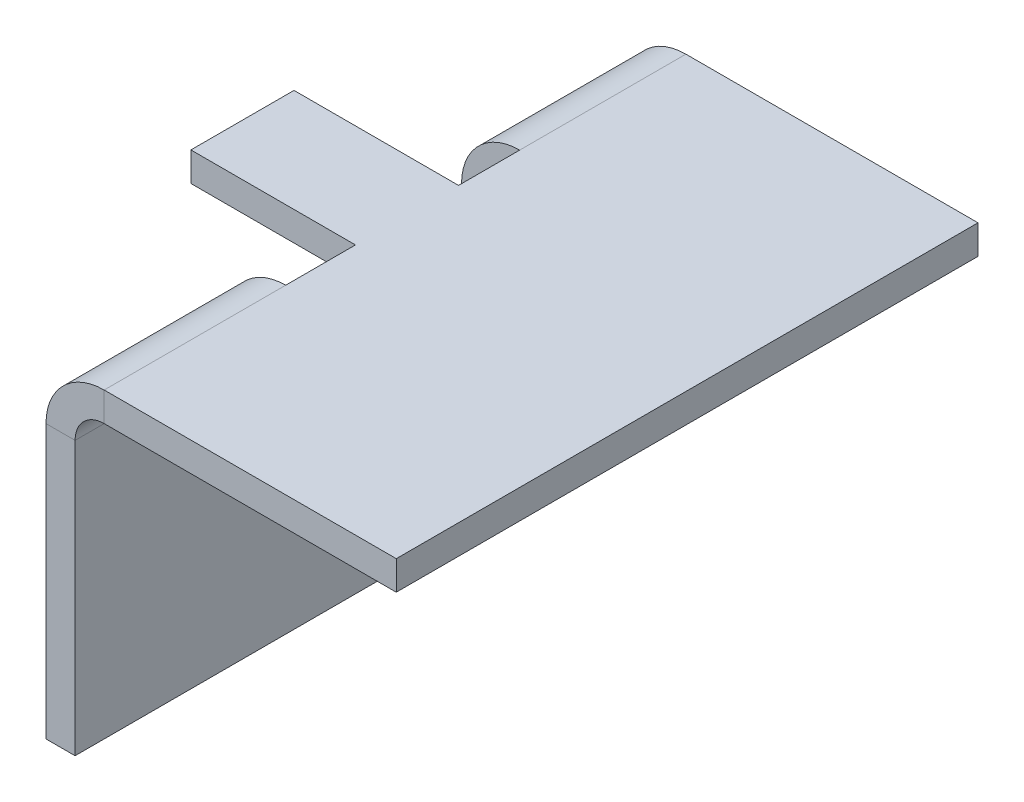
ISO-10303-21;
HEADER;
FILE_DESCRIPTION(('STEP AP214'),'2;1');
FILE_NAME('part.step','',(''),(''),'','','');
FILE_SCHEMA(('AUTOMOTIVE_DESIGN { 1 0 10303 214 1 1 1 1 }'));
ENDSEC;
DATA;
#1=APPLICATION_CONTEXT('core data for automotive mechanical design processes');
#2=APPLICATION_PROTOCOL_DEFINITION('international standard','automotive_design',2000,#1);
#3=PRODUCT_CONTEXT('',#1,'mechanical');
#4=PRODUCT('Part','Part','',(#3));
#5=PRODUCT_RELATED_PRODUCT_CATEGORY('part','',(#4));
#6=PRODUCT_DEFINITION_FORMATION('','',#4);
#7=PRODUCT_DEFINITION_CONTEXT('part definition',#1,'design');
#8=PRODUCT_DEFINITION('design','',#6,#7);
#9=PRODUCT_DEFINITION_SHAPE('','',#8);
#10=(LENGTH_UNIT() NAMED_UNIT(*) SI_UNIT(.MILLI.,.METRE.));
#11=(NAMED_UNIT(*) PLANE_ANGLE_UNIT() SI_UNIT($,.RADIAN.));
#12=(NAMED_UNIT(*) SI_UNIT($,.STERADIAN.) SOLID_ANGLE_UNIT());
#13=UNCERTAINTY_MEASURE_WITH_UNIT(LENGTH_MEASURE(1.E-05),#10,'distance_accuracy_value','');
#14=(GEOMETRIC_REPRESENTATION_CONTEXT(3) GLOBAL_UNCERTAINTY_ASSIGNED_CONTEXT((#13)) GLOBAL_UNIT_ASSIGNED_CONTEXT((#10,
#11,#12)) REPRESENTATION_CONTEXT('',''));
#15=CARTESIAN_POINT('',(0.,0.,0.));
#16=DIRECTION('',(0.,0.,1.));
#17=DIRECTION('',(1.,0.,0.));
#18=AXIS2_PLACEMENT_3D('',#15,#16,#17);
#19=CARTESIAN_POINT('',(6.,-3.,-0.790229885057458));
#20=DIRECTION('',(1.,0.,0.));
#21=DIRECTION('',(0.,0.,-1.));
#22=AXIS2_PLACEMENT_3D('',#19,#20,#21);
#23=PLANE('',#22);
#24=DIRECTION('',(0.,1.,0.));
#25=VECTOR('',#24,1.);
#26=CARTESIAN_POINT('',(6.,-3.,4.08177323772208));
#27=LINE('',#26,#25);
#28=CARTESIAN_POINT('',(6.,-3.,4.08177323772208));
#29=VERTEX_POINT('',#28);
#30=CARTESIAN_POINT('',(6.,0.,4.08177323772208));
#31=VERTEX_POINT('',#30);
#32=EDGE_CURVE('E512',#29,#31,#27,.T.);
#33=ORIENTED_EDGE('',*,*,#32,.F.);
#34=DIRECTION('',(0.,0.,-1.));
#35=VECTOR('',#34,1.);
#36=CARTESIAN_POINT('',(6.,-3.,30.));
#37=LINE('',#36,#35);
#38=CARTESIAN_POINT('',(6.,-3.,11.2787356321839));
#39=VERTEX_POINT('',#38);
#40=EDGE_CURVE('E523',#39,#29,#37,.T.);
#41=ORIENTED_EDGE('',*,*,#40,.F.);
#42=DIRECTION('',(0.,-1.,0.));
#43=VECTOR('',#42,1.);
#44=CARTESIAN_POINT('',(6.,-3.,11.2787356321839));
#45=LINE('',#44,#43);
#46=CARTESIAN_POINT('',(6.,0.,11.2787356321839));
#47=VERTEX_POINT('',#46);
#48=EDGE_CURVE('E528',#39,#47,#45,.F.);
#49=ORIENTED_EDGE('',*,*,#48,.T.);
#50=DIRECTION('',(0.,0.,-1.));
#51=VECTOR('',#50,1.);
#52=CARTESIAN_POINT('',(6.,0.,30.));
#53=LINE('',#52,#51);
#54=EDGE_CURVE('E367',#47,#31,#53,.T.);
#55=ORIENTED_EDGE('',*,*,#54,.T.);
#56=EDGE_LOOP('',(#33,#41,#49,#55));
#57=FACE_BOUND('',#56,.T.);
#58=ADVANCED_FACE('F352',(#57),#23,.F.);
#59=CARTESIAN_POINT('',(6.,-6.,30.));
#60=DIRECTION('',(0.,0.,-1.));
#61=DIRECTION('',(-1.,0.,0.));
#62=AXIS2_PLACEMENT_3D('',#59,#60,#61);
#63=CYLINDRICAL_SURFACE('',#62,6.);
#64=DIRECTION('',(0.,0.,-1.));
#65=VECTOR('',#64,1.);
#66=CARTESIAN_POINT('',(0.,-6.,30.));
#67=LINE('',#66,#65);
#68=CARTESIAN_POINT('',(0.,-6.00000000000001,-12.8591954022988));
#69=VERTEX_POINT('',#68);
#70=CARTESIAN_POINT('',(0.,-6.,-30.));
#71=VERTEX_POINT('',#70);
#72=EDGE_CURVE('E619',#69,#71,#67,.T.);
#73=ORIENTED_EDGE('',*,*,#72,.F.);
#74=CARTESIAN_POINT('',(6.,-6.,-12.8591954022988));
#75=DIRECTION('',(0.,0.,-1.));
#76=DIRECTION('',(-1.,0.,0.));
#77=AXIS2_PLACEMENT_3D('',#74,#75,#76);
#78=CIRCLE('',#77,6.);
#79=CARTESIAN_POINT('',(6.,0.,-12.8591954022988));
#80=VERTEX_POINT('',#79);
#81=EDGE_CURVE('E486',#80,#69,#78,.F.);
#82=ORIENTED_EDGE('',*,*,#81,.F.);
#83=DIRECTION('',(0.,0.,-1.));
#84=VECTOR('',#83,1.);
#85=CARTESIAN_POINT('',(6.,0.,30.));
#86=LINE('',#85,#84);
#87=CARTESIAN_POINT('',(6.,0.,-30.));
#88=VERTEX_POINT('',#87);
#89=EDGE_CURVE('E484',#80,#88,#86,.T.);
#90=ORIENTED_EDGE('',*,*,#89,.T.);
#91=CARTESIAN_POINT('',(6.,-6.,-30.));
#92=DIRECTION('',(0.,0.,1.));
#93=DIRECTION('',(1.,0.,0.));
#94=AXIS2_PLACEMENT_3D('',#91,#92,#93);
#95=CIRCLE('',#94,6.);
#96=EDGE_CURVE('E569',#71,#88,#95,.F.);
#97=ORIENTED_EDGE('',*,*,#96,.F.);
#98=EDGE_LOOP('',(#73,#82,#90,#97));
#99=FACE_BOUND('',#98,.T.);
#100=ADVANCED_FACE('F690',(#99),#63,.T.);
#101=CARTESIAN_POINT('',(6.,0.,30.));
#102=VERTEX_POINT('',#101);
#103=EDGE_CURVE('E623',#102,#47,#86,.T.);
#104=ORIENTED_EDGE('',*,*,#103,.T.);
#105=CARTESIAN_POINT('',(6.,-6.,11.2787356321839));
#106=DIRECTION('',(0.,0.,-1.));
#107=DIRECTION('',(-1.,0.,0.));
#108=AXIS2_PLACEMENT_3D('',#105,#106,#107);
#109=CIRCLE('',#108,6.);
#110=CARTESIAN_POINT('',(0.,-6.00000000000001,11.2787356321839));
#111=VERTEX_POINT('',#110);
#112=EDGE_CURVE('E526',#111,#47,#109,.T.);
#113=ORIENTED_EDGE('',*,*,#112,.F.);
#114=CARTESIAN_POINT('',(0.,-6.,30.));
#115=VERTEX_POINT('',#114);
#116=EDGE_CURVE('E620',#115,#111,#67,.T.);
#117=ORIENTED_EDGE('',*,*,#116,.F.);
#118=CARTESIAN_POINT('',(6.,-6.,30.));
#119=DIRECTION('',(0.,0.,1.));
#120=DIRECTION('',(1.,0.,0.));
#121=AXIS2_PLACEMENT_3D('',#118,#119,#120);
#122=CIRCLE('',#121,6.);
#123=EDGE_CURVE('E592',#115,#102,#122,.F.);
#124=ORIENTED_EDGE('',*,*,#123,.T.);
#125=EDGE_LOOP('',(#104,#113,#117,#124));
#126=FACE_BOUND('',#125,.T.);
#127=ADVANCED_FACE('F646',(#126),#63,.T.);
#128=CARTESIAN_POINT('',(0.,-34.1723060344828,30.));
#129=DIRECTION('',(-1.,0.,0.));
#130=DIRECTION('',(0.,0.,1.));
#131=AXIS2_PLACEMENT_3D('',#128,#129,#130);
#132=PLANE('',#131);
#133=DIRECTION('',(0.,0.,1.));
#134=VECTOR('',#133,1.);
#135=CARTESIAN_POINT('',(0.,-20.,30.));
#136=LINE('',#135,#134);
#137=CARTESIAN_POINT('',(0.,-20.,-12.8591954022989));
#138=VERTEX_POINT('',#137);
#139=CARTESIAN_POINT('',(0.,-20.,11.2787356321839));
#140=VERTEX_POINT('',#139);
#141=EDGE_CURVE('E544',#138,#140,#136,.T.);
#142=ORIENTED_EDGE('',*,*,#141,.F.);
#143=DIRECTION('',(0.,1.,0.));
#144=VECTOR('',#143,1.);
#145=CARTESIAN_POINT('',(0.,-34.1723060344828,-12.8591954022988));
#146=LINE('',#145,#144);
#147=EDGE_CURVE('E545',#69,#138,#146,.F.);
#148=ORIENTED_EDGE('',*,*,#147,.F.);
#149=ORIENTED_EDGE('',*,*,#72,.T.);
#150=DIRECTION('',(0.,1.,0.));
#151=VECTOR('',#150,1.);
#152=CARTESIAN_POINT('',(0.,-34.1723060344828,-30.));
#153=LINE('',#152,#151);
#154=CARTESIAN_POINT('',(0.,-34.1723060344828,-30.));
#155=VERTEX_POINT('',#154);
#156=EDGE_CURVE('E572',#155,#71,#153,.T.);
#157=ORIENTED_EDGE('',*,*,#156,.F.);
#158=DIRECTION('',(0.,0.,-1.));
#159=VECTOR('',#158,1.);
#160=CARTESIAN_POINT('',(0.,-34.1723060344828,30.));
#161=LINE('',#160,#159);
#162=CARTESIAN_POINT('',(0.,-34.1723060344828,30.));
#163=VERTEX_POINT('',#162);
#164=EDGE_CURVE('E617',#163,#155,#161,.T.);
#165=ORIENTED_EDGE('',*,*,#164,.F.);
#166=DIRECTION('',(0.,1.,0.));
#167=VECTOR('',#166,1.);
#168=CARTESIAN_POINT('',(0.,-34.1723060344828,30.));
#169=LINE('',#168,#167);
#170=EDGE_CURVE('E595',#163,#115,#169,.T.);
#171=ORIENTED_EDGE('',*,*,#170,.T.);
#172=ORIENTED_EDGE('',*,*,#116,.T.);
#173=DIRECTION('',(0.,1.,0.));
#174=VECTOR('',#173,1.);
#175=CARTESIAN_POINT('',(0.,-34.1723060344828,11.2787356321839));
#176=LINE('',#175,#174);
#177=EDGE_CURVE('E542',#140,#111,#176,.T.);
#178=ORIENTED_EDGE('',*,*,#177,.F.);
#179=EDGE_LOOP('',(#142,#148,#149,#157,#165,#171,#172,#178));
#180=FACE_BOUND('',#179,.T.);
#181=ADVANCED_FACE('F651',(#180),#132,.T.);
#182=CARTESIAN_POINT('',(3.,-34.1723060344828,30.));
#183=DIRECTION('',(-1.,0.,0.));
#184=DIRECTION('',(0.,0.,1.));
#185=AXIS2_PLACEMENT_3D('',#182,#183,#184);
#186=PLANE('',#185);
#187=DIRECTION('',(0.,-1.,0.));
#188=VECTOR('',#187,1.);
#189=CARTESIAN_POINT('',(3.,-34.1723060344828,-12.8591954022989));
#190=LINE('',#189,#188);
#191=CARTESIAN_POINT('',(3.,-6.,-12.8591954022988));
#192=VERTEX_POINT('',#191);
#193=CARTESIAN_POINT('',(3.,-20.,-12.8591954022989));
#194=VERTEX_POINT('',#193);
#195=EDGE_CURVE('E539',#192,#194,#190,.T.);
#196=ORIENTED_EDGE('',*,*,#195,.T.);
#197=DIRECTION('',(0.,0.,1.));
#198=VECTOR('',#197,1.);
#199=CARTESIAN_POINT('',(3.,-20.,30.));
#200=LINE('',#199,#198);
#201=CARTESIAN_POINT('',(3.,-20.,11.2787356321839));
#202=VERTEX_POINT('',#201);
#203=EDGE_CURVE('E536',#194,#202,#200,.T.);
#204=ORIENTED_EDGE('',*,*,#203,.T.);
#205=DIRECTION('',(0.,1.,0.));
#206=VECTOR('',#205,1.);
#207=CARTESIAN_POINT('',(3.,-34.1723060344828,11.2787356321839));
#208=LINE('',#207,#206);
#209=CARTESIAN_POINT('',(3.,-6.,11.2787356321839));
#210=VERTEX_POINT('',#209);
#211=EDGE_CURVE('E533',#202,#210,#208,.T.);
#212=ORIENTED_EDGE('',*,*,#211,.T.);
#213=DIRECTION('',(0.,0.,-1.));
#214=VECTOR('',#213,1.);
#215=CARTESIAN_POINT('',(3.,-6.,30.));
#216=LINE('',#215,#214);
#217=CARTESIAN_POINT('',(3.,-6.,30.));
#218=VERTEX_POINT('',#217);
#219=EDGE_CURVE('E612',#218,#210,#216,.T.);
#220=ORIENTED_EDGE('',*,*,#219,.F.);
#221=DIRECTION('',(0.,1.,0.));
#222=VECTOR('',#221,1.);
#223=CARTESIAN_POINT('',(3.,-34.1723060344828,30.));
#224=LINE('',#223,#222);
#225=CARTESIAN_POINT('',(3.,-34.1723060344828,30.));
#226=VERTEX_POINT('',#225);
#227=EDGE_CURVE('E601',#226,#218,#224,.T.);
#228=ORIENTED_EDGE('',*,*,#227,.F.);
#229=DIRECTION('',(0.,0.,-1.));
#230=VECTOR('',#229,1.);
#231=CARTESIAN_POINT('',(3.,-34.1723060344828,30.));
#232=LINE('',#231,#230);
#233=CARTESIAN_POINT('',(3.,-34.1723060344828,-30.));
#234=VERTEX_POINT('',#233);
#235=EDGE_CURVE('E615',#226,#234,#232,.T.);
#236=ORIENTED_EDGE('',*,*,#235,.T.);
#237=DIRECTION('',(0.,1.,0.));
#238=VECTOR('',#237,1.);
#239=CARTESIAN_POINT('',(3.,-34.1723060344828,-30.));
#240=LINE('',#239,#238);
#241=CARTESIAN_POINT('',(3.,-6.,-30.));
#242=VERTEX_POINT('',#241);
#243=EDGE_CURVE('E578',#234,#242,#240,.T.);
#244=ORIENTED_EDGE('',*,*,#243,.T.);
#245=EDGE_CURVE('E611',#192,#242,#216,.T.);
#246=ORIENTED_EDGE('',*,*,#245,.F.);
#247=EDGE_LOOP('',(#196,#204,#212,#220,#228,#236,#244,#246));
#248=FACE_BOUND('',#247,.T.);
#249=ADVANCED_FACE('F658',(#248),#186,.F.);
#250=CARTESIAN_POINT('',(6.,-6.,30.));
#251=DIRECTION('',(0.,0.,-1.));
#252=DIRECTION('',(-1.,0.,0.));
#253=AXIS2_PLACEMENT_3D('',#250,#251,#252);
#254=CYLINDRICAL_SURFACE('',#253,3.);
#255=CARTESIAN_POINT('',(6.,-6.,-12.8591954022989));
#256=DIRECTION('',(0.,0.,-1.));
#257=DIRECTION('',(-1.,0.,0.));
#258=AXIS2_PLACEMENT_3D('',#255,#256,#257);
#259=CIRCLE('',#258,3.);
#260=CARTESIAN_POINT('',(6.,-3.,-12.8591954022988));
#261=VERTEX_POINT('',#260);
#262=EDGE_CURVE('E520',#261,#192,#259,.F.);
#263=ORIENTED_EDGE('',*,*,#262,.T.);
#264=ORIENTED_EDGE('',*,*,#245,.T.);
#265=CARTESIAN_POINT('',(6.,-6.,-30.));
#266=DIRECTION('',(0.,0.,1.));
#267=DIRECTION('',(1.,0.,0.));
#268=AXIS2_PLACEMENT_3D('',#265,#266,#267);
#269=CIRCLE('',#268,3.);
#270=CARTESIAN_POINT('',(6.,-3.,-30.));
#271=VERTEX_POINT('',#270);
#272=EDGE_CURVE('E581',#242,#271,#269,.F.);
#273=ORIENTED_EDGE('',*,*,#272,.T.);
#274=DIRECTION('',(0.,0.,-1.));
#275=VECTOR('',#274,1.);
#276=CARTESIAN_POINT('',(6.,-3.,30.));
#277=LINE('',#276,#275);
#278=EDGE_CURVE('E607',#261,#271,#277,.T.);
#279=ORIENTED_EDGE('',*,*,#278,.F.);
#280=EDGE_LOOP('',(#263,#264,#273,#279));
#281=FACE_BOUND('',#280,.T.);
#282=ADVANCED_FACE('F731',(#281),#254,.F.);
#283=CARTESIAN_POINT('',(6.,-6.,11.2787356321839));
#284=DIRECTION('',(0.,0.,1.));
#285=DIRECTION('',(1.,0.,0.));
#286=AXIS2_PLACEMENT_3D('',#283,#284,#285);
#287=CIRCLE('',#286,3.);
#288=EDGE_CURVE('E514',#210,#39,#287,.F.);
#289=ORIENTED_EDGE('',*,*,#288,.T.);
#290=CARTESIAN_POINT('',(6.,-3.,30.));
#291=VERTEX_POINT('',#290);
#292=EDGE_CURVE('E608',#291,#39,#277,.T.);
#293=ORIENTED_EDGE('',*,*,#292,.F.);
#294=CARTESIAN_POINT('',(6.,-6.,30.));
#295=DIRECTION('',(0.,0.,1.));
#296=DIRECTION('',(1.,0.,0.));
#297=AXIS2_PLACEMENT_3D('',#294,#295,#296);
#298=CIRCLE('',#297,3.);
#299=EDGE_CURVE('E604',#218,#291,#298,.F.);
#300=ORIENTED_EDGE('',*,*,#299,.F.);
#301=ORIENTED_EDGE('',*,*,#219,.T.);
#302=EDGE_LOOP('',(#289,#293,#300,#301));
#303=FACE_BOUND('',#302,.T.);
#304=ADVANCED_FACE('F662',(#303),#254,.F.);
#305=CARTESIAN_POINT('',(6.,0.,30.));
#306=DIRECTION('',(0.,0.,1.));
#307=DIRECTION('',(1.,0.,0.));
#308=AXIS2_PLACEMENT_3D('',#305,#306,#307);
#309=PLANE('',#308);
#310=DIRECTION('',(0.,-1.,0.));
#311=VECTOR('',#310,1.);
#312=CARTESIAN_POINT('',(6.,0.,30.));
#313=LINE('',#312,#311);
#314=EDGE_CURVE('E11',#102,#291,#313,.T.);
#315=ORIENTED_EDGE('',*,*,#314,.F.);
#316=ORIENTED_EDGE('',*,*,#123,.F.);
#317=DIRECTION('',(-1.,0.,0.));
#318=VECTOR('',#317,1.);
#319=CARTESIAN_POINT('',(3.,-6.,30.));
#320=LINE('',#319,#318);
#321=EDGE_CURVE('E360',#218,#115,#320,.T.);
#322=ORIENTED_EDGE('',*,*,#321,.F.);
#323=ORIENTED_EDGE('',*,*,#299,.T.);
#324=EDGE_LOOP('',(#315,#316,#322,#323));
#325=FACE_BOUND('',#324,.T.);
#326=ADVANCED_FACE('F354',(#325),#309,.T.);
#327=CARTESIAN_POINT('',(3.,-6.,30.));
#328=DIRECTION('',(0.,0.,1.));
#329=DIRECTION('',(1.,0.,0.));
#330=AXIS2_PLACEMENT_3D('',#327,#328,#329);
#331=PLANE('',#330);
#332=DIRECTION('',(1.,0.,0.));
#333=VECTOR('',#332,1.);
#334=CARTESIAN_POINT('',(0.,0.,30.));
#335=LINE('',#334,#333);
#336=CARTESIAN_POINT('',(36.1293103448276,0.,30.));
#337=VERTEX_POINT('',#336);
#338=EDGE_CURVE('E589',#102,#337,#335,.T.);
#339=ORIENTED_EDGE('',*,*,#338,.F.);
#340=ORIENTED_EDGE('',*,*,#314,.T.);
#341=DIRECTION('',(1.,0.,0.));
#342=VECTOR('',#341,1.);
#343=CARTESIAN_POINT('',(0.,-3.,30.));
#344=LINE('',#343,#342);
#345=CARTESIAN_POINT('',(36.1293103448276,-3.,30.));
#346=VERTEX_POINT('',#345);
#347=EDGE_CURVE('E584',#291,#346,#344,.T.);
#348=ORIENTED_EDGE('',*,*,#347,.T.);
#349=DIRECTION('',(0.,-1.,0.));
#350=VECTOR('',#349,1.);
#351=CARTESIAN_POINT('',(36.1293103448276,0.,30.));
#352=LINE('',#351,#350);
#353=EDGE_CURVE('E586',#337,#346,#352,.T.);
#354=ORIENTED_EDGE('',*,*,#353,.F.);
#355=EDGE_LOOP('',(#339,#340,#348,#354));
#356=FACE_BOUND('',#355,.T.);
#357=ADVANCED_FACE('F670',(#356),#331,.T.);
#358=CARTESIAN_POINT('',(0.,-6.,-30.));
#359=DIRECTION('',(0.,0.,-1.));
#360=DIRECTION('',(-1.,0.,0.));
#361=AXIS2_PLACEMENT_3D('',#358,#359,#360);
#362=PLANE('',#361);
#363=DIRECTION('',(1.,0.,0.));
#364=VECTOR('',#363,1.);
#365=CARTESIAN_POINT('',(0.,-6.,-30.));
#366=LINE('',#365,#364);
#367=EDGE_CURVE('E633',#71,#242,#366,.T.);
#368=ORIENTED_EDGE('',*,*,#367,.F.);
#369=ORIENTED_EDGE('',*,*,#96,.T.);
#370=DIRECTION('',(0.,1.,0.));
#371=VECTOR('',#370,1.);
#372=CARTESIAN_POINT('',(6.,-3.,-30.));
#373=LINE('',#372,#371);
#374=EDGE_CURVE('E630',#271,#88,#373,.T.);
#375=ORIENTED_EDGE('',*,*,#374,.F.);
#376=ORIENTED_EDGE('',*,*,#272,.F.);
#377=EDGE_LOOP('',(#368,#369,#375,#376));
#378=FACE_BOUND('',#377,.T.);
#379=ADVANCED_FACE('F750',(#378),#362,.T.);
#380=CARTESIAN_POINT('',(6.,-3.,-30.));
#381=DIRECTION('',(0.,0.,-1.));
#382=DIRECTION('',(-1.,0.,0.));
#383=AXIS2_PLACEMENT_3D('',#380,#381,#382);
#384=PLANE('',#383);
#385=ORIENTED_EDGE('',*,*,#156,.T.);
#386=ORIENTED_EDGE('',*,*,#367,.T.);
#387=ORIENTED_EDGE('',*,*,#243,.F.);
#388=DIRECTION('',(-1.,0.,0.));
#389=VECTOR('',#388,1.);
#390=CARTESIAN_POINT('',(3.,-34.1723060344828,-30.));
#391=LINE('',#390,#389);
#392=EDGE_CURVE('E575',#234,#155,#391,.T.);
#393=ORIENTED_EDGE('',*,*,#392,.T.);
#394=EDGE_LOOP('',(#385,#386,#387,#393));
#395=FACE_BOUND('',#394,.T.);
#396=ADVANCED_FACE('F747',(#395),#384,.T.);
#397=CARTESIAN_POINT('',(0.,-3.,30.));
#398=DIRECTION('',(0.,1.,0.));
#399=DIRECTION('',(0.,0.,1.));
#400=AXIS2_PLACEMENT_3D('',#397,#398,#399);
#401=PLANE('',#400);
#402=DIRECTION('',(1.,0.,0.));
#403=VECTOR('',#402,1.);
#404=CARTESIAN_POINT('',(0.,-3.,-30.));
#405=LINE('',#404,#403);
#406=CARTESIAN_POINT('',(36.1293103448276,-3.,-30.));
#407=VERTEX_POINT('',#406);
#408=EDGE_CURVE('E558',#271,#407,#405,.T.);
#409=ORIENTED_EDGE('',*,*,#408,.T.);
#410=DIRECTION('',(0.,0.,-1.));
#411=VECTOR('',#410,1.);
#412=CARTESIAN_POINT('',(36.1293103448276,-3.,30.));
#413=LINE('',#412,#411);
#414=EDGE_CURVE('E628',#346,#407,#413,.T.);
#415=ORIENTED_EDGE('',*,*,#414,.F.);
#416=ORIENTED_EDGE('',*,*,#347,.F.);
#417=ORIENTED_EDGE('',*,*,#292,.T.);
#418=ORIENTED_EDGE('',*,*,#40,.T.);
#419=DIRECTION('',(1.,0.,0.));
#420=VECTOR('',#419,1.);
#421=CARTESIAN_POINT('',(6.,-3.,4.08177323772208));
#422=LINE('',#421,#420);
#423=CARTESIAN_POINT('',(-10.9725253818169,-3.,4.08177323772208));
#424=VERTEX_POINT('',#423);
#425=EDGE_CURVE('E494',#424,#29,#422,.T.);
#426=ORIENTED_EDGE('',*,*,#425,.F.);
#427=DIRECTION('',(0.,0.,1.));
#428=VECTOR('',#427,1.);
#429=CARTESIAN_POINT('',(-10.9725253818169,-3.,-6.55262168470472));
#430=LINE('',#429,#428);
#431=CARTESIAN_POINT('',(-10.9725253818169,-3.,-6.55262168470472));
#432=VERTEX_POINT('',#431);
#433=EDGE_CURVE('E507',#432,#424,#430,.T.);
#434=ORIENTED_EDGE('',*,*,#433,.F.);
#435=DIRECTION('',(-1.,0.,0.));
#436=VECTOR('',#435,1.);
#437=CARTESIAN_POINT('',(6.,-3.,-6.55262168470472));
#438=LINE('',#437,#436);
#439=CARTESIAN_POINT('',(6.,-3.,-6.5526216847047));
#440=VERTEX_POINT('',#439);
#441=EDGE_CURVE('E505',#440,#432,#438,.T.);
#442=ORIENTED_EDGE('',*,*,#441,.F.);
#443=EDGE_CURVE('E375',#440,#261,#37,.T.);
#444=ORIENTED_EDGE('',*,*,#443,.T.);
#445=ORIENTED_EDGE('',*,*,#278,.T.);
#446=EDGE_LOOP('',(#409,#415,#416,#417,#418,#426,#434,#442,#444,#445));
#447=FACE_BOUND('',#446,.T.);
#448=ADVANCED_FACE('F666',(#447),#401,.F.);
#449=CARTESIAN_POINT('',(36.1293103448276,0.,30.));
#450=DIRECTION('',(1.,0.,0.));
#451=DIRECTION('',(0.,0.,-1.));
#452=AXIS2_PLACEMENT_3D('',#449,#450,#451);
#453=PLANE('',#452);
#454=DIRECTION('',(0.,-1.,0.));
#455=VECTOR('',#454,1.);
#456=CARTESIAN_POINT('',(36.1293103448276,0.,-30.));
#457=LINE('',#456,#455);
#458=CARTESIAN_POINT('',(36.1293103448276,0.,-30.));
#459=VERTEX_POINT('',#458);
#460=EDGE_CURVE('E563',#459,#407,#457,.T.);
#461=ORIENTED_EDGE('',*,*,#460,.F.);
#462=DIRECTION('',(0.,0.,-1.));
#463=VECTOR('',#462,1.);
#464=CARTESIAN_POINT('',(36.1293103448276,0.,30.));
#465=LINE('',#464,#463);
#466=EDGE_CURVE('E626',#337,#459,#465,.T.);
#467=ORIENTED_EDGE('',*,*,#466,.F.);
#468=ORIENTED_EDGE('',*,*,#353,.T.);
#469=ORIENTED_EDGE('',*,*,#414,.T.);
#470=EDGE_LOOP('',(#461,#467,#468,#469));
#471=FACE_BOUND('',#470,.T.);
#472=ADVANCED_FACE('F742',(#471),#453,.T.);
#473=CARTESIAN_POINT('',(0.,0.,30.));
#474=DIRECTION('',(0.,1.,0.));
#475=DIRECTION('',(0.,0.,1.));
#476=AXIS2_PLACEMENT_3D('',#473,#474,#475);
#477=PLANE('',#476);
#478=DIRECTION('',(1.,0.,0.));
#479=VECTOR('',#478,1.);
#480=CARTESIAN_POINT('',(0.,0.,-30.));
#481=LINE('',#480,#479);
#482=EDGE_CURVE('E566',#88,#459,#481,.T.);
#483=ORIENTED_EDGE('',*,*,#482,.F.);
#484=ORIENTED_EDGE('',*,*,#89,.F.);
#485=CARTESIAN_POINT('',(6.,0.,-6.55262168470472));
#486=VERTEX_POINT('',#485);
#487=EDGE_CURVE('E478',#486,#80,#53,.T.);
#488=ORIENTED_EDGE('',*,*,#487,.F.);
#489=DIRECTION('',(-1.,0.,0.));
#490=VECTOR('',#489,1.);
#491=CARTESIAN_POINT('',(6.,0.,-6.55262168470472));
#492=LINE('',#491,#490);
#493=CARTESIAN_POINT('',(-10.9725253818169,0.,-6.55262168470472));
#494=VERTEX_POINT('',#493);
#495=EDGE_CURVE('E483',#486,#494,#492,.T.);
#496=ORIENTED_EDGE('',*,*,#495,.T.);
#497=DIRECTION('',(0.,0.,1.));
#498=VECTOR('',#497,1.);
#499=CARTESIAN_POINT('',(-10.9725253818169,0.,-6.55262168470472));
#500=LINE('',#499,#498);
#501=CARTESIAN_POINT('',(-10.9725253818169,0.,4.08177323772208));
#502=VERTEX_POINT('',#501);
#503=EDGE_CURVE('E498',#494,#502,#500,.T.);
#504=ORIENTED_EDGE('',*,*,#503,.T.);
#505=DIRECTION('',(1.,0.,0.));
#506=VECTOR('',#505,1.);
#507=CARTESIAN_POINT('',(6.,0.,4.08177323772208));
#508=LINE('',#507,#506);
#509=EDGE_CURVE('E500',#502,#31,#508,.T.);
#510=ORIENTED_EDGE('',*,*,#509,.T.);
#511=ORIENTED_EDGE('',*,*,#54,.F.);
#512=ORIENTED_EDGE('',*,*,#103,.F.);
#513=ORIENTED_EDGE('',*,*,#338,.T.);
#514=ORIENTED_EDGE('',*,*,#466,.T.);
#515=EDGE_LOOP('',(#483,#484,#488,#496,#504,#510,#511,#512,#513,#514));
#516=FACE_BOUND('',#515,.T.);
#517=ADVANCED_FACE('F480',(#516),#477,.T.);
#518=CARTESIAN_POINT('',(3.,-34.1723060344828,30.));
#519=DIRECTION('',(0.,-1.,0.));
#520=DIRECTION('',(0.,0.,-1.));
#521=AXIS2_PLACEMENT_3D('',#518,#519,#520);
#522=PLANE('',#521);
#523=ORIENTED_EDGE('',*,*,#392,.F.);
#524=ORIENTED_EDGE('',*,*,#235,.F.);
#525=DIRECTION('',(-1.,0.,0.));
#526=VECTOR('',#525,1.);
#527=CARTESIAN_POINT('',(3.,-34.1723060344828,30.));
#528=LINE('',#527,#526);
#529=EDGE_CURVE('E598',#226,#163,#528,.T.);
#530=ORIENTED_EDGE('',*,*,#529,.T.);
#531=ORIENTED_EDGE('',*,*,#164,.T.);
#532=EDGE_LOOP('',(#523,#524,#530,#531));
#533=FACE_BOUND('',#532,.T.);
#534=ADVANCED_FACE('F655',(#533),#522,.T.);
#535=CARTESIAN_POINT('',(6.,-6.,30.));
#536=DIRECTION('',(0.,0.,1.));
#537=DIRECTION('',(1.,0.,0.));
#538=AXIS2_PLACEMENT_3D('',#535,#536,#537);
#539=PLANE('',#538);
#540=ORIENTED_EDGE('',*,*,#227,.T.);
#541=ORIENTED_EDGE('',*,*,#321,.T.);
#542=ORIENTED_EDGE('',*,*,#170,.F.);
#543=ORIENTED_EDGE('',*,*,#529,.F.);
#544=EDGE_LOOP('',(#540,#541,#542,#543));
#545=FACE_BOUND('',#544,.T.);
#546=ADVANCED_FACE('F638',(#545),#539,.T.);
#547=CARTESIAN_POINT('',(6.,-6.,-30.));
#548=DIRECTION('',(0.,0.,1.));
#549=DIRECTION('',(1.,0.,0.));
#550=AXIS2_PLACEMENT_3D('',#547,#548,#549);
#551=PLANE('',#550);
#552=ORIENTED_EDGE('',*,*,#408,.F.);
#553=ORIENTED_EDGE('',*,*,#374,.T.);
#554=ORIENTED_EDGE('',*,*,#482,.T.);
#555=ORIENTED_EDGE('',*,*,#460,.T.);
#556=EDGE_LOOP('',(#552,#553,#554,#555));
#557=FACE_BOUND('',#556,.T.);
#558=ADVANCED_FACE('F723',(#557),#551,.F.);
#559=CARTESIAN_POINT('',(3.,-34.1723060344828,-12.8591954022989));
#560=DIRECTION('',(0.,0.,-1.));
#561=DIRECTION('',(0.,-1.,0.));
#562=AXIS2_PLACEMENT_3D('',#559,#560,#561);
#563=PLANE('',#562);
#564=DIRECTION('',(1.,0.,0.));
#565=VECTOR('',#564,1.);
#566=CARTESIAN_POINT('',(3.,-20.,-12.8591954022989));
#567=LINE('',#566,#565);
#568=EDGE_CURVE('E556',#194,#138,#567,.F.);
#569=ORIENTED_EDGE('',*,*,#568,.F.);
#570=ORIENTED_EDGE('',*,*,#195,.F.);
#571=DIRECTION('',(1.,0.,0.));
#572=VECTOR('',#571,1.);
#573=CARTESIAN_POINT('',(3.,-6.,-12.8591954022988));
#574=LINE('',#573,#572);
#575=EDGE_CURVE('E553',#192,#69,#574,.F.);
#576=ORIENTED_EDGE('',*,*,#575,.T.);
#577=ORIENTED_EDGE('',*,*,#147,.T.);
#578=EDGE_LOOP('',(#569,#570,#576,#577));
#579=FACE_BOUND('',#578,.T.);
#580=ADVANCED_FACE('F720',(#579),#563,.F.);
#581=CARTESIAN_POINT('',(3.,-34.1723060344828,11.2787356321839));
#582=DIRECTION('',(0.,0.,1.));
#583=DIRECTION('',(0.,1.,0.));
#584=AXIS2_PLACEMENT_3D('',#581,#582,#583);
#585=PLANE('',#584);
#586=DIRECTION('',(1.,0.,0.));
#587=VECTOR('',#586,1.);
#588=CARTESIAN_POINT('',(3.,-6.,11.2787356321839));
#589=LINE('',#588,#587);
#590=EDGE_CURVE('E550',#210,#111,#589,.F.);
#591=ORIENTED_EDGE('',*,*,#590,.F.);
#592=ORIENTED_EDGE('',*,*,#211,.F.);
#593=DIRECTION('',(1.,0.,0.));
#594=VECTOR('',#593,1.);
#595=CARTESIAN_POINT('',(3.,-20.,11.2787356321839));
#596=LINE('',#595,#594);
#597=EDGE_CURVE('E548',#202,#140,#596,.F.);
#598=ORIENTED_EDGE('',*,*,#597,.T.);
#599=ORIENTED_EDGE('',*,*,#177,.T.);
#600=EDGE_LOOP('',(#591,#592,#598,#599));
#601=FACE_BOUND('',#600,.T.);
#602=ADVANCED_FACE('F715',(#601),#585,.F.);
#603=CARTESIAN_POINT('',(3.,-20.,30.));
#604=DIRECTION('',(0.,-1.,0.));
#605=DIRECTION('',(0.,0.,1.));
#606=AXIS2_PLACEMENT_3D('',#603,#604,#605);
#607=PLANE('',#606);
#608=ORIENTED_EDGE('',*,*,#203,.F.);
#609=ORIENTED_EDGE('',*,*,#568,.T.);
#610=ORIENTED_EDGE('',*,*,#141,.T.);
#611=ORIENTED_EDGE('',*,*,#597,.F.);
#612=EDGE_LOOP('',(#608,#609,#610,#611));
#613=FACE_BOUND('',#612,.T.);
#614=ADVANCED_FACE('F709',(#613),#607,.F.);
#615=CARTESIAN_POINT('',(6.,-6.,-12.8591954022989));
#616=DIRECTION('',(0.,0.,1.));
#617=DIRECTION('',(1.,0.,0.));
#618=AXIS2_PLACEMENT_3D('',#615,#616,#617);
#619=PLANE('',#618);
#620=ORIENTED_EDGE('',*,*,#575,.F.);
#621=ORIENTED_EDGE('',*,*,#262,.F.);
#622=DIRECTION('',(0.,-1.,0.));
#623=VECTOR('',#622,1.);
#624=CARTESIAN_POINT('',(6.,-3.,-12.8591954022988));
#625=LINE('',#624,#623);
#626=EDGE_CURVE('E531',#261,#80,#625,.F.);
#627=ORIENTED_EDGE('',*,*,#626,.T.);
#628=ORIENTED_EDGE('',*,*,#81,.T.);
#629=EDGE_LOOP('',(#620,#621,#627,#628));
#630=FACE_BOUND('',#629,.T.);
#631=ADVANCED_FACE('F702',(#630),#619,.T.);
#632=DIRECTION('',(0.,1.,0.));
#633=VECTOR('',#632,1.);
#634=CARTESIAN_POINT('',(6.,-3.,-6.55262168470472));
#635=LINE('',#634,#633);
#636=EDGE_CURVE('E488',#440,#486,#635,.T.);
#637=ORIENTED_EDGE('',*,*,#636,.T.);
#638=ORIENTED_EDGE('',*,*,#487,.T.);
#639=ORIENTED_EDGE('',*,*,#626,.F.);
#640=ORIENTED_EDGE('',*,*,#443,.F.);
#641=EDGE_LOOP('',(#637,#638,#639,#640));
#642=FACE_BOUND('',#641,.T.);
#643=ADVANCED_FACE('F489',(#642),#23,.F.);
#644=CARTESIAN_POINT('',(6.,-6.,11.2787356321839));
#645=DIRECTION('',(0.,0.,-1.));
#646=DIRECTION('',(-1.,0.,0.));
#647=AXIS2_PLACEMENT_3D('',#644,#645,#646);
#648=PLANE('',#647);
#649=ORIENTED_EDGE('',*,*,#48,.F.);
#650=ORIENTED_EDGE('',*,*,#288,.F.);
#651=ORIENTED_EDGE('',*,*,#590,.T.);
#652=ORIENTED_EDGE('',*,*,#112,.T.);
#653=EDGE_LOOP('',(#649,#650,#651,#652));
#654=FACE_BOUND('',#653,.T.);
#655=ADVANCED_FACE('F687',(#654),#648,.T.);
#656=CARTESIAN_POINT('',(6.,-3.,4.08177323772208));
#657=DIRECTION('',(0.,0.,1.));
#658=DIRECTION('',(1.,0.,0.));
#659=AXIS2_PLACEMENT_3D('',#656,#657,#658);
#660=PLANE('',#659);
#661=ORIENTED_EDGE('',*,*,#509,.F.);
#662=DIRECTION('',(0.,1.,0.));
#663=VECTOR('',#662,1.);
#664=CARTESIAN_POINT('',(-10.9725253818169,-3.,4.08177323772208));
#665=LINE('',#664,#663);
#666=EDGE_CURVE('E515',#424,#502,#665,.T.);
#667=ORIENTED_EDGE('',*,*,#666,.F.);
#668=ORIENTED_EDGE('',*,*,#425,.T.);
#669=ORIENTED_EDGE('',*,*,#32,.T.);
#670=EDGE_LOOP('',(#661,#667,#668,#669));
#671=FACE_BOUND('',#670,.T.);
#672=ADVANCED_FACE('F674',(#671),#660,.T.);
#673=CARTESIAN_POINT('',(-10.9725253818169,-3.,-6.55262168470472));
#674=DIRECTION('',(-1.,0.,0.));
#675=DIRECTION('',(0.,0.,1.));
#676=AXIS2_PLACEMENT_3D('',#673,#674,#675);
#677=PLANE('',#676);
#678=ORIENTED_EDGE('',*,*,#503,.F.);
#679=DIRECTION('',(0.,1.,0.));
#680=VECTOR('',#679,1.);
#681=CARTESIAN_POINT('',(-10.9725253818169,-3.,-6.55262168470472));
#682=LINE('',#681,#680);
#683=EDGE_CURVE('E493',#432,#494,#682,.T.);
#684=ORIENTED_EDGE('',*,*,#683,.F.);
#685=ORIENTED_EDGE('',*,*,#433,.T.);
#686=ORIENTED_EDGE('',*,*,#666,.T.);
#687=EDGE_LOOP('',(#678,#684,#685,#686));
#688=FACE_BOUND('',#687,.T.);
#689=ADVANCED_FACE('F679',(#688),#677,.T.);
#690=CARTESIAN_POINT('',(6.,-3.,-6.55262168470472));
#691=DIRECTION('',(0.,0.,-1.));
#692=DIRECTION('',(-1.,0.,0.));
#693=AXIS2_PLACEMENT_3D('',#690,#691,#692);
#694=PLANE('',#693);
#695=ORIENTED_EDGE('',*,*,#495,.F.);
#696=ORIENTED_EDGE('',*,*,#636,.F.);
#697=ORIENTED_EDGE('',*,*,#441,.T.);
#698=ORIENTED_EDGE('',*,*,#683,.T.);
#699=EDGE_LOOP('',(#695,#696,#697,#698));
#700=FACE_BOUND('',#699,.T.);
#701=ADVANCED_FACE('F496',(#700),#694,.T.);
#702=CLOSED_SHELL('',(#58,#100,#127,#181,#249,#282,#304,#326,#357,#379,#396,#448,#472,#517,#534,
#546,#558,#580,#602,#614,#631,#643,#655,#672,#689,#701));
#703=MANIFOLD_SOLID_BREP('B2',#702);
#704=ADVANCED_BREP_SHAPE_REPRESENTATION('',(#18,#703),#14);
#705=SHAPE_DEFINITION_REPRESENTATION(#9,#704);
ENDSEC;
END-ISO-10303-21;
